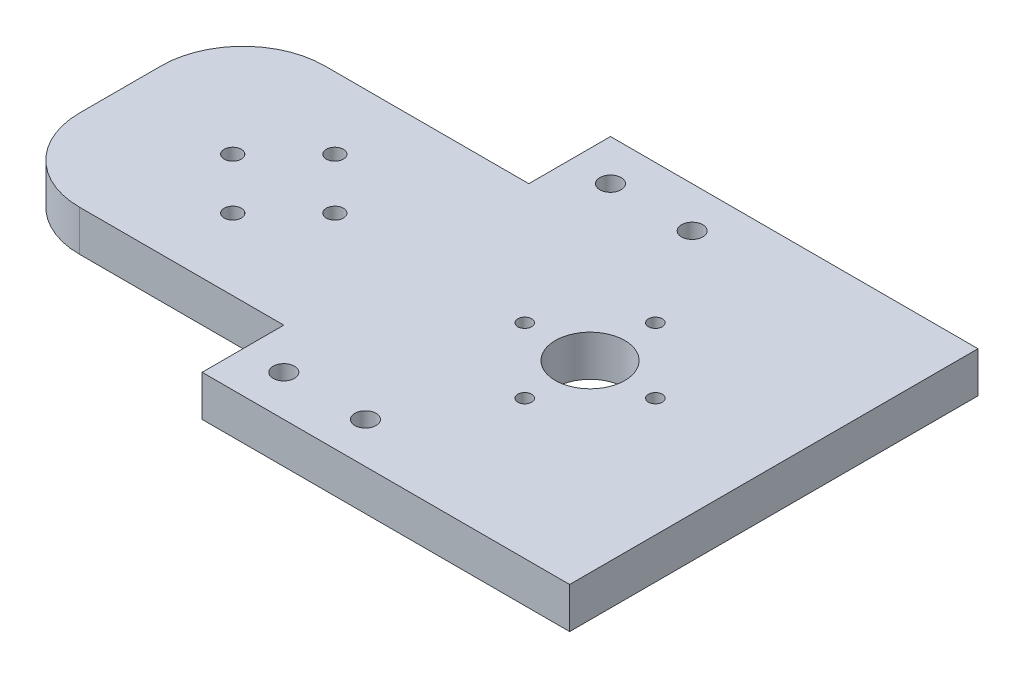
from build123d import *

# Parameters (mm, degrees)
EXTRUDE_2_DEPTH      = 10
FILLET_2_R           = 20
SKETCH_4_R           = 2.6
CUT_EXTRUDE_2_DEPTH  = 168.928556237
SKETCH_5_R           = 8.5
CUT_EXTRUDE_3_DEPTH  = 168.928556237
SKETCH_17_R          = 1.7
CUT_EXTRUDE_11_DEPTH = 10
SKETCH_18_R          = 2.1
CUT_EXTRUDE_12_DEPTH = 10


with BuildPart() as part:
    # Sketch 2 → Extrude 2 (new body)
    with BuildSketch(Plane(origin=(0, 0, 0), x_dir=(1, 0, 0), z_dir=(0, 1, 0))):
        Polygon((0, 50), (0, -50), (-90, -50), (-90, -30), (-160, -30), (-160, 30), (-90, 30), (-90, 50), align=None)
    extrude(amount=EXTRUDE_2_DEPTH)

    # Fillet 2
    fillet_2_edges = [part.edges().sort_by_distance(p)[0] for p in [
        (-160, 5, 30),
        (-160, 5, -30),
    ]]
    fillet(fillet_2_edges, radius=FILLET_2_R)

    # Sketch 4 → Cut-Extrude 2 (cut, through all)
    with BuildSketch(Plane(origin=(0, 10, 0), x_dir=(1, 0, 0), z_dir=(0, 1, 0))):
        with Locations(Location((-60, -40, 0), (0, 0, 270))):
            Circle(SKETCH_4_R)
        with Locations(Location((-80, -40, 0), (0, 0, 270))):
            Circle(SKETCH_4_R)
        with Locations(Location((-80, 40, 0), (0, 0, 270))):
            Circle(SKETCH_4_R)
        with Locations(Location((-60, 40, 0), (0, 0, 270))):
            Circle(SKETCH_4_R)
    extrude(amount=-CUT_EXTRUDE_2_DEPTH, mode=Mode.SUBTRACT)

    # Sketch 5 → Cut-Extrude 3 (cut, through all)
    with BuildSketch(Plane.XZ):
        with Locations(Location((-45, 0, 0), (0, 0, 270))):
            Circle(SKETCH_5_R)
    extrude(amount=-CUT_EXTRUDE_3_DEPTH, mode=Mode.SUBTRACT)

    # Sketch 17 → Cut-Extrude 11 (cut)
    with BuildSketch(Plane.XZ):
        with Locations(Location((-45, 16, 0), (0, 0, 270))):
            Circle(SKETCH_17_R)
        with Locations(Location((-45, -16, 0), (0, 0, 270))):
            Circle(SKETCH_17_R)
        with Locations(Location((-29, 0, 0), (0, 0, 270))):
            Circle(SKETCH_17_R)
        with Locations(Location((-61, 0, 0), (0, 0, 90))):
            Circle(SKETCH_17_R)
    extrude(amount=-CUT_EXTRUDE_11_DEPTH, mode=Mode.SUBTRACT)

    # Sketch 18 → Cut-Extrude 12 (cut)
    with BuildSketch(Plane.XZ):
        with Locations(Location((-120, 12.5, 0), (0, 0, 270))):
            Circle(SKETCH_18_R)
        with Locations(Location((-132.5, 0, 0), (0, 0, 270))):
            Circle(SKETCH_18_R)
        with Locations(Location((-120, -12.5, 0), (0, 0, 270))):
            Circle(SKETCH_18_R)
        with Locations(Location((-107.5, 0, 0), (0, 0, 270))):
            Circle(SKETCH_18_R)
    extrude(amount=-CUT_EXTRUDE_12_DEPTH, mode=Mode.SUBTRACT)


solid = part.part
